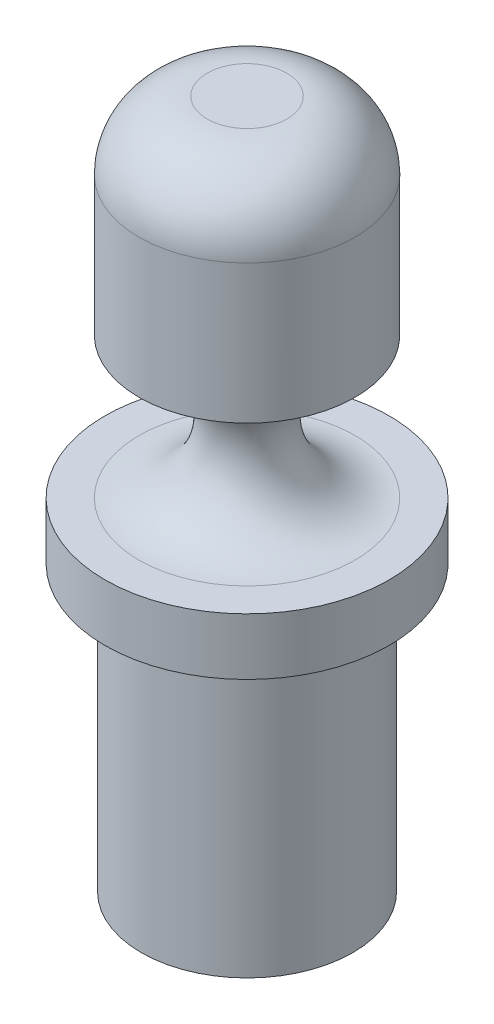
from build123d import *

# Parameters (mm, degrees)
FILLET1_R = 1.524


with BuildPart() as part:
    # Sketch1 → Revolve1 (revolve)
    with BuildSketch(Plane.XY, mode=Mode.PRIVATE) as revolve1_sk:
        with BuildLine():
            Line((0, 0), (2.3622, 0))
            Line((2.3622, 0), (2.3622, 6.35))
            Line((2.3622, 6.35), (3.175, 6.35))
            Line((3.175, 6.35), (3.175, 7.62))
            Line((3.175, 7.62), (2.413, 7.62))
            ThreePointArc((2.413, 7.62), (0.8382, 9.1948), (2.413, 10.7696))
            Line((2.413, 10.7696), (2.413, 15.3924))
            Line((2.413, 15.3924), (0, 15.3924))
            Line((0, 15.3924), (0, 0))
        make_face()
    revolve(revolve1_sk.sketch.rotate(Axis((0, 63.280674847, 0), (0, -1, 0)), 90), axis=Axis((0, 63.280674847, 0), (0, -1, 0)))

    # Fillet1
    fillet1_edges = [part.edges().sort_by_distance(p)[0] for p in [
        (0, 15.3924, -2.413),
    ]]
    fillet(fillet1_edges, radius=FILLET1_R)


solid = part.part
